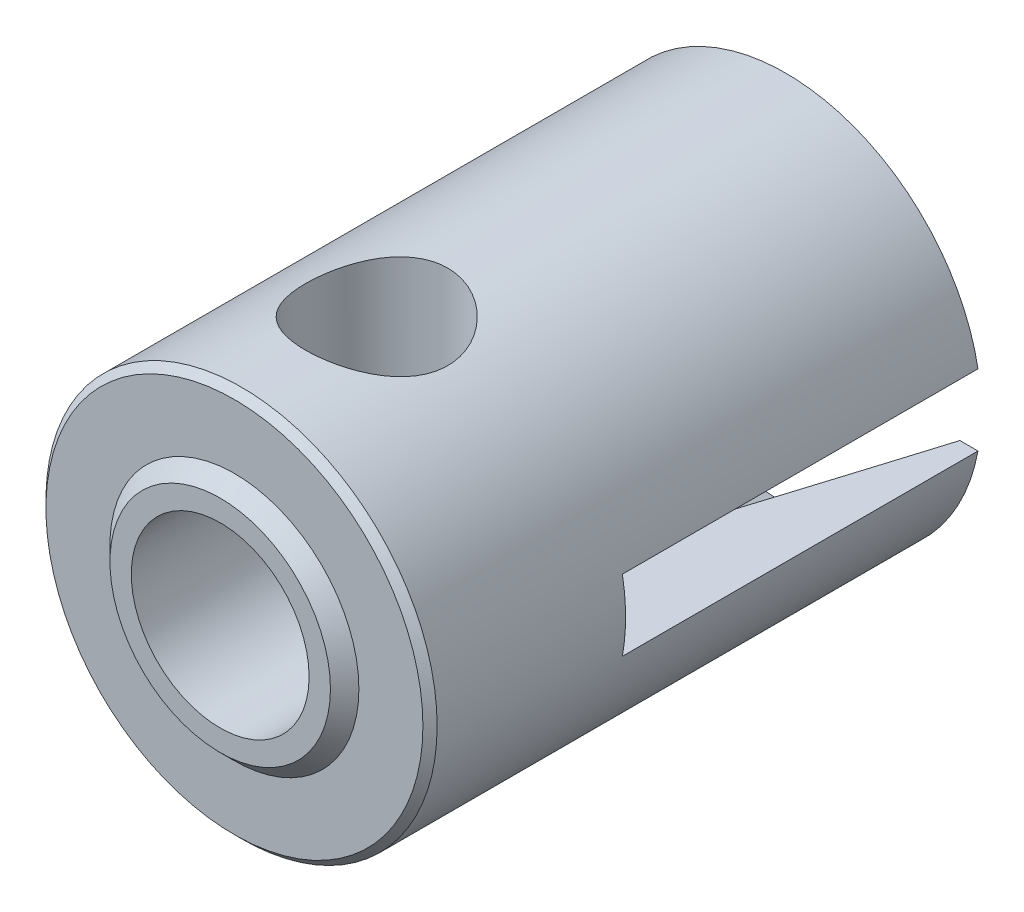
ISO-10303-21;
HEADER;
FILE_DESCRIPTION(('STEP AP214'),'2;1');
FILE_NAME('part.step','',(''),(''),'','','');
FILE_SCHEMA(('AUTOMOTIVE_DESIGN { 1 0 10303 214 1 1 1 1 }'));
ENDSEC;
DATA;
#1=APPLICATION_CONTEXT('core data for automotive mechanical design processes');
#2=APPLICATION_PROTOCOL_DEFINITION('international standard','automotive_design',2000,#1);
#3=PRODUCT_CONTEXT('',#1,'mechanical');
#4=PRODUCT('Part','Part','',(#3));
#5=PRODUCT_RELATED_PRODUCT_CATEGORY('part','',(#4));
#6=PRODUCT_DEFINITION_FORMATION('','',#4);
#7=PRODUCT_DEFINITION_CONTEXT('part definition',#1,'design');
#8=PRODUCT_DEFINITION('design','',#6,#7);
#9=PRODUCT_DEFINITION_SHAPE('','',#8);
#10=(LENGTH_UNIT() NAMED_UNIT(*) SI_UNIT(.MILLI.,.METRE.));
#11=(NAMED_UNIT(*) PLANE_ANGLE_UNIT() SI_UNIT($,.RADIAN.));
#12=(NAMED_UNIT(*) SI_UNIT($,.STERADIAN.) SOLID_ANGLE_UNIT());
#13=UNCERTAINTY_MEASURE_WITH_UNIT(LENGTH_MEASURE(1.E-05),#10,'distance_accuracy_value','');
#14=(GEOMETRIC_REPRESENTATION_CONTEXT(3) GLOBAL_UNCERTAINTY_ASSIGNED_CONTEXT((#13)) GLOBAL_UNIT_ASSIGNED_CONTEXT((#10,
#11,#12)) REPRESENTATION_CONTEXT('',''));
#15=CARTESIAN_POINT('',(0.,0.,0.));
#16=DIRECTION('',(0.,0.,1.));
#17=DIRECTION('',(1.,0.,0.));
#18=AXIS2_PLACEMENT_3D('',#15,#16,#17);
#19=CARTESIAN_POINT('',(0.,0.,0.));
#20=DIRECTION('',(0.,0.,1.));
#21=DIRECTION('',(1.,0.,0.));
#22=AXIS2_PLACEMENT_3D('',#19,#20,#21);
#23=PLANE('',#22);
#24=CARTESIAN_POINT('',(0.,0.,0.));
#25=DIRECTION('',(0.,0.,1.));
#26=DIRECTION('',(1.,0.,0.));
#27=AXIS2_PLACEMENT_3D('',#24,#25,#26);
#28=CIRCLE('',#27,5.5);
#29=CARTESIAN_POINT('',(-5.40832691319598,-1.,0.));
#30=VERTEX_POINT('',#29);
#31=CARTESIAN_POINT('',(5.40832691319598,-1.,0.));
#32=VERTEX_POINT('',#31);
#33=EDGE_CURVE('E520',#30,#32,#28,.T.);
#34=ORIENTED_EDGE('',*,*,#33,.F.);
#35=DIRECTION('',(1.,0.,0.));
#36=VECTOR('',#35,1.);
#37=CARTESIAN_POINT('',(-5.5,-1.,0.));
#38=LINE('',#37,#36);
#39=CARTESIAN_POINT('',(-4.89897948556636,-1.,0.));
#40=VERTEX_POINT('',#39);
#41=EDGE_CURVE('E626',#30,#40,#38,.T.);
#42=ORIENTED_EDGE('',*,*,#41,.T.);
#43=CARTESIAN_POINT('',(0.,0.,0.));
#44=DIRECTION('',(0.,0.,1.));
#45=DIRECTION('',(1.,0.,0.));
#46=AXIS2_PLACEMENT_3D('',#43,#44,#45);
#47=CIRCLE('',#46,5.);
#48=CARTESIAN_POINT('',(4.89897948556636,-1.,0.));
#49=VERTEX_POINT('',#48);
#50=EDGE_CURVE('E538',#40,#49,#47,.T.);
#51=ORIENTED_EDGE('',*,*,#50,.T.);
#52=EDGE_CURVE('E655',#49,#32,#38,.T.);
#53=ORIENTED_EDGE('',*,*,#52,.T.);
#54=EDGE_LOOP('',(#34,#42,#51,#53));
#55=FACE_BOUND('',#54,.T.);
#56=ADVANCED_FACE('F350',(#55),#23,.F.);
#57=CARTESIAN_POINT('',(0.,0.,9.));
#58=DIRECTION('',(0.,0.,-1.));
#59=DIRECTION('',(-1.,0.,0.));
#60=AXIS2_PLACEMENT_3D('',#57,#58,#59);
#61=PLANE('',#60);
#62=DIRECTION('',(-1.,0.,0.));
#63=VECTOR('',#62,1.);
#64=CARTESIAN_POINT('',(0.,-1.,9.));
#65=LINE('',#64,#63);
#66=CARTESIAN_POINT('',(3.35410196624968,-1.,9.));
#67=VERTEX_POINT('',#66);
#68=CARTESIAN_POINT('',(2.29128784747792,-1.,9.));
#69=VERTEX_POINT('',#68);
#70=EDGE_CURVE('E487',#67,#69,#65,.T.);
#71=ORIENTED_EDGE('',*,*,#70,.F.);
#72=CARTESIAN_POINT('',(0.,0.,9.));
#73=DIRECTION('',(0.,0.,-1.));
#74=DIRECTION('',(-1.,0.,0.));
#75=AXIS2_PLACEMENT_3D('',#72,#73,#74);
#76=CIRCLE('',#75,3.5);
#77=CARTESIAN_POINT('',(-3.35410196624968,-1.,9.));
#78=VERTEX_POINT('',#77);
#79=EDGE_CURVE('E512',#67,#78,#76,.T.);
#80=ORIENTED_EDGE('',*,*,#79,.T.);
#81=CARTESIAN_POINT('',(-2.29128784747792,-1.,9.));
#82=VERTEX_POINT('',#81);
#83=EDGE_CURVE('E490',#82,#78,#65,.T.);
#84=ORIENTED_EDGE('',*,*,#83,.F.);
#85=CARTESIAN_POINT('',(0.,0.,9.));
#86=DIRECTION('',(0.,0.,-1.));
#87=DIRECTION('',(-1.,0.,0.));
#88=AXIS2_PLACEMENT_3D('',#85,#86,#87);
#89=CIRCLE('',#88,2.5);
#90=EDGE_CURVE('E517',#82,#69,#89,.F.);
#91=ORIENTED_EDGE('',*,*,#90,.T.);
#92=EDGE_LOOP('',(#71,#80,#84,#91));
#93=FACE_BOUND('',#92,.T.);
#94=ADVANCED_FACE('F594',(#93),#61,.T.);
#95=CARTESIAN_POINT('',(0.,0.,9.));
#96=DIRECTION('',(0.,0.,-1.));
#97=DIRECTION('',(-1.,0.,0.));
#98=AXIS2_PLACEMENT_3D('',#95,#96,#97);
#99=CYLINDRICAL_SURFACE('',#98,3.5);
#100=CARTESIAN_POINT('',(0.,0.,5.));
#101=DIRECTION('',(0.,0.,1.));
#102=DIRECTION('',(1.,0.,0.));
#103=AXIS2_PLACEMENT_3D('',#100,#101,#102);
#104=CIRCLE('',#103,3.5);
#105=CARTESIAN_POINT('',(3.35410196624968,-1.,5.));
#106=VERTEX_POINT('',#105);
#107=CARTESIAN_POINT('',(-3.35410196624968,-1.,5.));
#108=VERTEX_POINT('',#107);
#109=EDGE_CURVE('E535',#106,#108,#104,.F.);
#110=ORIENTED_EDGE('',*,*,#109,.T.);
#111=DIRECTION('',(0.,0.,-1.));
#112=VECTOR('',#111,1.);
#113=CARTESIAN_POINT('',(-3.35410196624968,-1.,9.));
#114=LINE('',#113,#112);
#115=EDGE_CURVE('E493',#108,#78,#114,.F.);
#116=ORIENTED_EDGE('',*,*,#115,.T.);
#117=ORIENTED_EDGE('',*,*,#79,.F.);
#118=DIRECTION('',(0.,0.,-1.));
#119=VECTOR('',#118,1.);
#120=CARTESIAN_POINT('',(3.35410196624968,-1.,9.));
#121=LINE('',#120,#119);
#122=EDGE_CURVE('E479',#67,#106,#121,.T.);
#123=ORIENTED_EDGE('',*,*,#122,.T.);
#124=EDGE_LOOP('',(#110,#116,#117,#123));
#125=FACE_BOUND('',#124,.T.);
#126=ADVANCED_FACE('F601',(#125),#99,.F.);
#127=CARTESIAN_POINT('',(0.,0.,5.));
#128=DIRECTION('',(0.,0.,-1.));
#129=DIRECTION('',(-1.,0.,0.));
#130=AXIS2_PLACEMENT_3D('',#127,#128,#129);
#131=CONICAL_SURFACE('',#130,3.5,0.291456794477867);
#132=CARTESIAN_POINT('',(-6.51638081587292,-1.,-5.3088800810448));
#133=CARTESIAN_POINT('',(-6.34494406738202,-1.,-4.74405709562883));
#134=CARTESIAN_POINT('',(-6.17337565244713,-1.,-4.17927400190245));
#135=CARTESIAN_POINT('',(-5.82987160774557,-1.,-3.04981983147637));
#136=CARTESIAN_POINT('',(-5.65793597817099,-1.,-2.48514875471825));
#137=CARTESIAN_POINT('',(-5.31354405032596,-1.,-1.35578828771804));
#138=CARTESIAN_POINT('',(-5.14108761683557,-1.,-0.791098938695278));
#139=CARTESIAN_POINT('',(-4.79553897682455,-1.,0.338085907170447));
#140=CARTESIAN_POINT('',(-4.62244676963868,-1.,0.9025814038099));
#141=CARTESIAN_POINT('',(-4.27538625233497,-1.,2.03129424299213));
#142=CARTESIAN_POINT('',(-4.10141795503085,-1.,2.5955115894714));
#143=CARTESIAN_POINT('',(-3.83950774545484,-1.,3.44153975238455));
#144=CARTESIAN_POINT('',(-3.75204492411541,-1.,3.72349882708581));
#145=CARTESIAN_POINT('',(-3.57671998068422,-1.,4.28729403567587));
#146=CARTESIAN_POINT('',(-3.48885785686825,-1.,4.56913016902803));
#147=CARTESIAN_POINT('',(-3.22458264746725,-1.,5.41429940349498));
#148=CARTESIAN_POINT('',(-3.04744558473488,-1.,5.97740708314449));
#149=CARTESIAN_POINT('',(-2.77932712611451,-1.,6.82130026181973));
#150=CARTESIAN_POINT('',(-2.68955246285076,-1.,7.10246900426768));
#151=CARTESIAN_POINT('',(-2.50891248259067,-1.,7.66445565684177));
#152=CARTESIAN_POINT('',(-2.41804716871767,-1.,7.94527356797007));
#153=CARTESIAN_POINT('',(-2.23478363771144,-1.,8.50650029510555));
#154=CARTESIAN_POINT('',(-2.14238497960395,-1.,8.7869089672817));
#155=CARTESIAN_POINT('',(-1.95542554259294,-1.,9.34699050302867));
#156=CARTESIAN_POINT('',(-1.8608648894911,-1.,9.62666340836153));
#157=CARTESIAN_POINT('',(-1.71648742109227,-1.,10.0453420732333));
#158=CARTESIAN_POINT('',(-1.66793198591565,-1.,10.1847823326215));
#159=CARTESIAN_POINT('',(-1.56973068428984,-1.,10.4632753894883));
#160=CARTESIAN_POINT('',(-1.52008484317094,-1.,10.6023281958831));
#161=CARTESIAN_POINT('',(-1.41935257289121,-1.,10.8799422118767));
#162=CARTESIAN_POINT('',(-1.36826588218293,-1.,11.0185033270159));
#163=CARTESIAN_POINT('',(-1.29016387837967,-1.,11.2257969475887));
#164=CARTESIAN_POINT('',(-1.26388349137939,-1.,11.2948061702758));
#165=CARTESIAN_POINT('',(-1.21073086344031,-1.,11.432597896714));
#166=CARTESIAN_POINT('',(-1.18385860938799,-1.,11.5013803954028));
#167=CARTESIAN_POINT('',(-1.15664010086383,-1.,11.5700268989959));
#168=B_SPLINE_CURVE_WITH_KNOTS('',3,(#132,#133,#134,#135,#136,#137,#138,#139,#140,#141,#142,
#143,#144,#145,#146,#147,#148,#149,#150,#151,#152,#153,#154,#155,#156,#157,#158,#159,#160,#161,
#162,#163,#164,#165,#166,#167),.UNSPECIFIED.,.F.,.F.,(4,2,2,2,2,2,2,2,2,2,2,2,2,2,2,2,2,4),(0.,
1.77080218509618,3.54160344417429,5.31291271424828,7.08422383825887,8.85550912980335,
9.74114756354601,10.626789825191,12.3977172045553,13.2831750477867,14.1686303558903,
15.0543448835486,15.940008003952,16.3829616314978,16.8259049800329,17.2689292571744,
17.4904587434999,17.7119931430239),.UNSPECIFIED.);
#169=EDGE_CURVE('E576',#108,#40,#168,.F.);
#170=ORIENTED_EDGE('',*,*,#169,.F.);
#171=ORIENTED_EDGE('',*,*,#109,.F.);
#172=CARTESIAN_POINT('',(6.51638081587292,-1.,-5.3088800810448));
#173=CARTESIAN_POINT('',(6.34494406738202,-1.,-4.74405709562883));
#174=CARTESIAN_POINT('',(6.17337565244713,-1.,-4.17927400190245));
#175=CARTESIAN_POINT('',(5.82987160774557,-1.,-3.04981983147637));
#176=CARTESIAN_POINT('',(5.65793597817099,-1.,-2.48514875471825));
#177=CARTESIAN_POINT('',(5.31354405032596,-1.,-1.35578828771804));
#178=CARTESIAN_POINT('',(5.14108761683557,-1.,-0.791098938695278));
#179=CARTESIAN_POINT('',(4.79553897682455,-1.,0.338085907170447));
#180=CARTESIAN_POINT('',(4.62244676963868,-1.,0.9025814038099));
#181=CARTESIAN_POINT('',(4.27538625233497,-1.,2.03129424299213));
#182=CARTESIAN_POINT('',(4.10141795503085,-1.,2.5955115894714));
#183=CARTESIAN_POINT('',(3.83950774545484,-1.,3.44153975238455));
#184=CARTESIAN_POINT('',(3.75204492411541,-1.,3.72349882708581));
#185=CARTESIAN_POINT('',(3.57671998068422,-1.,4.28729403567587));
#186=CARTESIAN_POINT('',(3.48885785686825,-1.,4.56913016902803));
#187=CARTESIAN_POINT('',(3.22458264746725,-1.,5.41429940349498));
#188=CARTESIAN_POINT('',(3.04744558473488,-1.,5.97740708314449));
#189=CARTESIAN_POINT('',(2.77932712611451,-1.,6.82130026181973));
#190=CARTESIAN_POINT('',(2.68955246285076,-1.,7.10246900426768));
#191=CARTESIAN_POINT('',(2.50891248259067,-1.,7.66445565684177));
#192=CARTESIAN_POINT('',(2.41804716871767,-1.,7.94527356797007));
#193=CARTESIAN_POINT('',(2.23478363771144,-1.,8.50650029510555));
#194=CARTESIAN_POINT('',(2.14238497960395,-1.,8.7869089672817));
#195=CARTESIAN_POINT('',(1.95542554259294,-1.,9.34699050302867));
#196=CARTESIAN_POINT('',(1.8608648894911,-1.,9.62666340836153));
#197=CARTESIAN_POINT('',(1.71648742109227,-1.,10.0453420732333));
#198=CARTESIAN_POINT('',(1.66793198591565,-1.,10.1847823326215));
#199=CARTESIAN_POINT('',(1.56973068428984,-1.,10.4632753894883));
#200=CARTESIAN_POINT('',(1.52008484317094,-1.,10.6023281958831));
#201=CARTESIAN_POINT('',(1.41935257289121,-1.,10.8799422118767));
#202=CARTESIAN_POINT('',(1.36826588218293,-1.,11.0185033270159));
#203=CARTESIAN_POINT('',(1.29016387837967,-1.,11.2257969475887));
#204=CARTESIAN_POINT('',(1.26388349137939,-1.,11.2948061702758));
#205=CARTESIAN_POINT('',(1.21073086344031,-1.,11.432597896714));
#206=CARTESIAN_POINT('',(1.18385860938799,-1.,11.5013803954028));
#207=CARTESIAN_POINT('',(1.15664010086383,-1.,11.5700268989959));
#208=B_SPLINE_CURVE_WITH_KNOTS('',3,(#172,#173,#174,#175,#176,#177,#178,#179,#180,#181,#182,
#183,#184,#185,#186,#187,#188,#189,#190,#191,#192,#193,#194,#195,#196,#197,#198,#199,#200,#201,
#202,#203,#204,#205,#206,#207),.UNSPECIFIED.,.F.,.F.,(4,2,2,2,2,2,2,2,2,2,2,2,2,2,2,2,2,4),(0.,
1.77080218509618,3.54160344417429,5.31291271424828,7.08422383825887,8.85550912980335,
9.74114756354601,10.626789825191,12.3977172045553,13.2831750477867,14.1686303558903,
15.0543448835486,15.940008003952,16.3829616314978,16.8259049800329,17.2689292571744,
17.4904587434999,17.7119931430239),.UNSPECIFIED.);
#209=EDGE_CURVE('E571',#49,#106,#208,.T.);
#210=ORIENTED_EDGE('',*,*,#209,.F.);
#211=ORIENTED_EDGE('',*,*,#50,.F.);
#212=EDGE_LOOP('',(#170,#171,#210,#211));
#213=FACE_BOUND('',#212,.T.);
#214=ADVANCED_FACE('F564',(#213),#131,.F.);
#215=CARTESIAN_POINT('',(0.,0.,0.));
#216=DIRECTION('',(0.,0.,1.));
#217=DIRECTION('',(1.,0.,0.));
#218=AXIS2_PLACEMENT_3D('',#215,#216,#217);
#219=CYLINDRICAL_SURFACE('',#218,2.5);
#220=CARTESIAN_POINT('',(0.,2.5,9.5));
#221=CARTESIAN_POINT('',(-0.0959968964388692,2.49999264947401,9.50000757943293));
#222=CARTESIAN_POINT('',(-0.192133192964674,2.49441368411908,9.50696942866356));
#223=CARTESIAN_POINT('',(-0.381319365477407,2.47259269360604,9.53434994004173));
#224=CARTESIAN_POINT('',(-0.474361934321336,2.45632708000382,9.55479837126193));
#225=CARTESIAN_POINT('',(-0.654094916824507,2.4146672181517,9.60767827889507));
#226=CARTESIAN_POINT('',(-0.740821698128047,2.38933120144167,9.64003335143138));
#227=CARTESIAN_POINT('',(-0.906926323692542,2.33136010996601,9.71511734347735));
#228=CARTESIAN_POINT('',(-0.986304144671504,2.29872501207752,9.75784629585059));
#229=CARTESIAN_POINT('',(-1.16318123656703,2.21575664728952,9.86862836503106));
#230=CARTESIAN_POINT('',(-1.25736767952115,2.16321748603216,9.94031891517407));
#231=CARTESIAN_POINT('',(-1.43041367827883,2.05292192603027,10.0972780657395));
#232=CARTESIAN_POINT('',(-1.50922761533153,1.99515072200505,10.1825857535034));
#233=CARTESIAN_POINT('',(-1.6521591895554,1.87856001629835,10.3667739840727));
#234=CARTESIAN_POINT('',(-1.71602638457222,1.81973830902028,10.4658467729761));
#235=CARTESIAN_POINT('',(-1.82646834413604,1.7088210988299,10.6765387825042));
#236=CARTESIAN_POINT('',(-1.87310099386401,1.65670347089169,10.788114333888));
#237=CARTESIAN_POINT('',(-1.93086043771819,1.58835652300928,10.973878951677));
#238=CARTESIAN_POINT('',(-1.94865475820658,1.56628727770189,11.0438117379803));
#239=CARTESIAN_POINT('',(-1.97673396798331,1.53069889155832,11.1872126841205));
#240=CARTESIAN_POINT('',(-1.98703731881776,1.5171587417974,11.260671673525));
#241=CARTESIAN_POINT('',(-1.99939840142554,1.50084234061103,11.410192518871));
#242=CARTESIAN_POINT('',(-2.00138345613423,1.49816096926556,11.4862714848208));
#243=CARTESIAN_POINT('',(-1.99669481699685,1.50439962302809,11.6377048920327));
#244=CARTESIAN_POINT('',(-1.99001379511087,1.51332946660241,11.7130586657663));
#245=CARTESIAN_POINT('',(-1.9669530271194,1.5432072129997,11.8722223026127));
#246=CARTESIAN_POINT('',(-1.94921808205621,1.56581842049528,11.955508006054));
#247=CARTESIAN_POINT('',(-1.90444547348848,1.61997459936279,12.116535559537));
#248=CARTESIAN_POINT('',(-1.87738025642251,1.65154598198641,12.1942601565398));
#249=CARTESIAN_POINT('',(-1.79974102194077,1.73656116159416,12.380662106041));
#250=CARTESIAN_POINT('',(-1.74414886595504,1.79313372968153,12.4858026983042));
#251=CARTESIAN_POINT('',(-1.61638467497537,1.90913780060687,12.6837166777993));
#252=CARTESIAN_POINT('',(-1.54418846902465,1.96857337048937,12.7764717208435));
#253=CARTESIAN_POINT('',(-1.38145818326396,2.08612751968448,12.9512747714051));
#254=CARTESIAN_POINT('',(-1.29048701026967,2.14416889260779,13.0329719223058));
#255=CARTESIAN_POINT('',(-1.09198491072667,2.25171871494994,13.1800994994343));
#256=CARTESIAN_POINT('',(-0.98449964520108,2.3012499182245,13.2455735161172));
#257=CARTESIAN_POINT('',(-0.787777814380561,2.37424585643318,13.3405628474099));
#258=CARTESIAN_POINT('',(-0.702177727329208,2.40111071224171,13.3750045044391));
#259=CARTESIAN_POINT('',(-0.524913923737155,2.44597564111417,13.432126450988));
#260=CARTESIAN_POINT('',(-0.433254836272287,2.46398239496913,13.4548156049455));
#261=CARTESIAN_POINT('',(-0.24571323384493,2.48970335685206,13.4871385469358));
#262=CARTESIAN_POINT('',(-0.149811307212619,2.49736378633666,13.496704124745));
#263=CARTESIAN_POINT('',(0.0426080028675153,2.50148682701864,13.5018590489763));
#264=CARTESIAN_POINT('',(0.13912526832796,2.49795152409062,13.4974509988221));
#265=CARTESIAN_POINT('',(0.32174667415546,2.48076858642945,13.4759171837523));
#266=CARTESIAN_POINT('',(0.408060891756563,2.46796352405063,13.459850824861));
#267=CARTESIAN_POINT('',(0.576335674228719,2.43417513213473,13.4171278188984));
#268=CARTESIAN_POINT('',(0.658294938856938,2.41318937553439,13.3904680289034));
#269=CARTESIAN_POINT('',(0.821235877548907,2.36289849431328,13.3258496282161));
#270=CARTESIAN_POINT('',(0.901843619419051,2.33315912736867,13.2872942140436));
#271=CARTESIAN_POINT('',(1.0554100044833,2.2678362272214,13.2011378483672));
#272=CARTESIAN_POINT('',(1.12836826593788,2.23225240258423,13.1535364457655));
#273=CARTESIAN_POINT('',(1.27925237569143,2.14993687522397,13.0407756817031));
#274=CARTESIAN_POINT('',(1.35550718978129,2.1023696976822,12.973998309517));
#275=CARTESIAN_POINT('',(1.4965368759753,2.0044349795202,12.830613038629));
#276=CARTESIAN_POINT('',(1.56127777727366,1.95405970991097,12.7539771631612));
#277=CARTESIAN_POINT('',(1.65568487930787,1.87374135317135,12.6235655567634));
#278=CARTESIAN_POINT('',(1.68913741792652,1.84354743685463,12.5726394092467));
#279=CARTESIAN_POINT('',(1.75155001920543,1.78435415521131,12.4673777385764));
#280=CARTESIAN_POINT('',(1.78050769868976,1.75535542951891,12.4130404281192));
#281=CARTESIAN_POINT('',(1.83358089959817,1.69983828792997,12.3011251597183));
#282=CARTESIAN_POINT('',(1.85771431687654,1.67331090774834,12.2435602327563));
#283=CARTESIAN_POINT('',(1.90088481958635,1.62410209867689,12.124991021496));
#284=CARTESIAN_POINT('',(1.9199255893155,1.60141789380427,12.0639892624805));
#285=CARTESIAN_POINT('',(1.95360165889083,1.5601942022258,11.9339132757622));
#286=CARTESIAN_POINT('',(1.96779559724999,1.54209716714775,11.8645773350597));
#287=CARTESIAN_POINT('',(1.98878905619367,1.5149337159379,11.723162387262));
#288=CARTESIAN_POINT('',(1.99560723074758,1.50584452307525,11.6510907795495));
#289=CARTESIAN_POINT('',(2.00132058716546,1.49824736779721,11.5056512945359));
#290=CARTESIAN_POINT('',(2.00017319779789,1.49979625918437,11.4322785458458));
#291=CARTESIAN_POINT('',(1.98996519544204,1.51330771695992,11.2870158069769));
#292=CARTESIAN_POINT('',(1.98089203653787,1.52528679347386,11.2151283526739));
#293=CARTESIAN_POINT('',(1.95207745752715,1.56207076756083,11.0553932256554));
#294=CARTESIAN_POINT('',(1.93009230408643,1.5894925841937,10.9685769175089));
#295=CARTESIAN_POINT('',(1.87608177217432,1.65288907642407,10.8013665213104));
#296=CARTESIAN_POINT('',(1.84402681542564,1.68888887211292,10.7209922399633));
#297=CARTESIAN_POINT('',(1.78094746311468,1.75491158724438,10.5878222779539));
#298=CARTESIAN_POINT('',(1.7520236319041,1.78388907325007,10.5334808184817));
#299=CARTESIAN_POINT('',(1.68964733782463,1.84307948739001,10.4281617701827));
#300=CARTESIAN_POINT('',(1.65619322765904,1.87329286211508,10.3771854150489));
#301=CARTESIAN_POINT('',(1.54918435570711,1.96437997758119,10.2292205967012));
#302=CARTESIAN_POINT('',(1.4689854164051,2.02569808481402,10.1372013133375));
#303=CARTESIAN_POINT('',(1.29001718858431,2.14418278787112,9.96661053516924));
#304=CARTESIAN_POINT('',(1.19101966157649,2.201284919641,9.88822977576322));
#305=CARTESIAN_POINT('',(1.02998399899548,2.27874650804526,9.78442327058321));
#306=CARTESIAN_POINT('',(0.974255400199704,2.30318868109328,9.75213155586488));
#307=CARTESIAN_POINT('',(0.858854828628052,2.34866115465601,9.69263189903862));
#308=CARTESIAN_POINT('',(0.79918529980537,2.36969354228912,9.6654208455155));
#309=CARTESIAN_POINT('',(0.655037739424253,2.41420905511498,9.60821994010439));
#310=CARTESIAN_POINT('',(0.569110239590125,2.43602892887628,9.58051732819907));
#311=CARTESIAN_POINT('',(0.392713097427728,2.47058864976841,9.5368423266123));
#312=CARTESIAN_POINT('',(0.302256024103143,2.48335227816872,9.52083921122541));
#313=CARTESIAN_POINT('',(0.175880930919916,2.49405378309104,9.5074369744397));
#314=CARTESIAN_POINT('',(0.140808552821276,2.49627918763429,9.50465262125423));
#315=CARTESIAN_POINT('',(0.07049707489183,2.499253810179,9.50093253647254));
#316=CARTESIAN_POINT('',(0.0352579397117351,2.50000269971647,9.49999721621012));
#317=CARTESIAN_POINT('',(0.,2.5,9.5));
#318=B_SPLINE_CURVE_WITH_KNOTS('',3,(#220,#221,#222,#223,#224,#225,#226,#227,#228,#229,#230,
#231,#232,#233,#234,#235,#236,#237,#238,#239,#240,#241,#242,#243,#244,#245,#246,#247,#248,#249,
#250,#251,#252,#253,#254,#255,#256,#257,#258,#259,#260,#261,#262,#263,#264,#265,#266,#267,#268,
#269,#270,#271,#272,#273,#274,#275,#276,#277,#278,#279,#280,#281,#282,#283,#284,#285,#286,#287,
#288,#289,#290,#291,#292,#293,#294,#295,#296,#297,#298,#299,#300,#301,#302,#303,#304,#305,#306,
#307,#308,#309,#310,#311,#312,#313,#314,#315,#316,#317),.UNSPECIFIED.,.T.,.F.,(4,2,2,2,2,2,2,2,
2,2,2,2,2,2,2,2,2,2,2,2,2,2,2,2,2,2,2,2,2,2,2,2,2,2,2,2,2,2,2,2,2,2,2,2,2,2,2,2,4),(0.,
0.287836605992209,0.576310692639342,0.862965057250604,1.14962032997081,1.53607888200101,
1.92366738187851,2.31734741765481,2.70969292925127,2.9353448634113,3.1604387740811,
3.38749528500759,3.61474392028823,3.87758630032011,4.14121163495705,4.534257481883,
4.92787915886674,5.33198173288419,5.73498644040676,6.02213978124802,6.30907621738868,
6.59749843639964,6.88586692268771,7.15087004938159,7.41595185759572,7.69742753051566,
7.97891724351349,8.31365537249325,8.64936529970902,8.85316560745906,9.0570736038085,
9.26021055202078,9.46320013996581,9.68152133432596,9.89928907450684,10.1182215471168,
10.3375012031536,10.616933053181,10.8971934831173,11.1010640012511,11.3050088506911,
11.7129165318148,12.1261363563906,12.3324811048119,12.5386990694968,12.8161540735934,
13.0928777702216,13.1985714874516,13.3042887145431),.UNSPECIFIED.);
#319=CARTESIAN_POINT('',(0.,2.5,9.5));
#320=VERTEX_POINT('',#319);
#321=EDGE_CURVE('E621',#320,#320,#318,.T.);
#322=ORIENTED_EDGE('',*,*,#321,.T.);
#323=EDGE_LOOP('',(#322));
#324=FACE_BOUND('',#323,.T.);
#325=CARTESIAN_POINT('',(0.,0.,15.9));
#326=DIRECTION('',(0.,0.,1.));
#327=DIRECTION('',(1.,0.,0.));
#328=AXIS2_PLACEMENT_3D('',#325,#326,#327);
#329=CIRCLE('',#328,2.5);
#330=CARTESIAN_POINT('',(2.5,0.,15.9));
#331=VERTEX_POINT('',#330);
#332=EDGE_CURVE('E513',#331,#331,#329,.T.);
#333=ORIENTED_EDGE('',*,*,#332,.T.);
#334=EDGE_LOOP('',(#333));
#335=FACE_BOUND('',#334,.T.);
#336=ORIENTED_EDGE('',*,*,#90,.F.);
#337=DIRECTION('',(0.,0.,1.));
#338=VECTOR('',#337,1.);
#339=CARTESIAN_POINT('',(-2.29128784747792,-1.,0.));
#340=LINE('',#339,#338);
#341=CARTESIAN_POINT('',(-2.29128784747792,-1.,10.));
#342=VERTEX_POINT('',#341);
#343=EDGE_CURVE('E496',#82,#342,#340,.T.);
#344=ORIENTED_EDGE('',*,*,#343,.T.);
#345=CARTESIAN_POINT('',(0.,0.,10.));
#346=DIRECTION('',(0.,0.,1.));
#347=DIRECTION('',(1.,0.,0.));
#348=AXIS2_PLACEMENT_3D('',#345,#346,#347);
#349=CIRCLE('',#348,2.5);
#350=CARTESIAN_POINT('',(-2.29128784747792,0.999999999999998,10.));
#351=VERTEX_POINT('',#350);
#352=EDGE_CURVE('E507',#342,#351,#349,.F.);
#353=ORIENTED_EDGE('',*,*,#352,.T.);
#354=DIRECTION('',(0.,0.,1.));
#355=VECTOR('',#354,1.);
#356=CARTESIAN_POINT('',(-2.29128784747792,1.,0.));
#357=LINE('',#356,#355);
#358=CARTESIAN_POINT('',(-2.29128784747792,0.999999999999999,9.));
#359=VERTEX_POINT('',#358);
#360=EDGE_CURVE('E469',#351,#359,#357,.F.);
#361=ORIENTED_EDGE('',*,*,#360,.T.);
#362=CARTESIAN_POINT('',(2.29128784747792,0.999999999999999,9.));
#363=VERTEX_POINT('',#362);
#364=EDGE_CURVE('E511',#363,#359,#89,.F.);
#365=ORIENTED_EDGE('',*,*,#364,.F.);
#366=DIRECTION('',(0.,0.,1.));
#367=VECTOR('',#366,1.);
#368=CARTESIAN_POINT('',(2.29128784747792,1.,0.));
#369=LINE('',#368,#367);
#370=CARTESIAN_POINT('',(2.29128784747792,0.999999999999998,10.));
#371=VERTEX_POINT('',#370);
#372=EDGE_CURVE('E628',#363,#371,#369,.T.);
#373=ORIENTED_EDGE('',*,*,#372,.T.);
#374=CARTESIAN_POINT('',(2.29128784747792,-1.,10.));
#375=VERTEX_POINT('',#374);
#376=EDGE_CURVE('E504',#371,#375,#349,.F.);
#377=ORIENTED_EDGE('',*,*,#376,.T.);
#378=DIRECTION('',(0.,0.,1.));
#379=VECTOR('',#378,1.);
#380=CARTESIAN_POINT('',(2.29128784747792,-1.,0.));
#381=LINE('',#380,#379);
#382=EDGE_CURVE('E489',#375,#69,#381,.F.);
#383=ORIENTED_EDGE('',*,*,#382,.T.);
#384=EDGE_LOOP('',(#336,#344,#353,#361,#365,#373,#377,#383));
#385=FACE_BOUND('',#384,.T.);
#386=ADVANCED_FACE('F642',(#324,#335,#385),#219,.F.);
#387=CARTESIAN_POINT('',(0.,0.,15.5));
#388=DIRECTION('',(0.,0.,1.));
#389=DIRECTION('',(1.,0.,0.));
#390=AXIS2_PLACEMENT_3D('',#387,#388,#389);
#391=PLANE('',#390);
#392=CARTESIAN_POINT('',(0.,0.,15.5));
#393=DIRECTION('',(0.,0.,1.));
#394=DIRECTION('',(1.,0.,0.));
#395=AXIS2_PLACEMENT_3D('',#392,#393,#394);
#396=CIRCLE('',#395,5.3);
#397=CARTESIAN_POINT('',(5.3,0.,15.5));
#398=VERTEX_POINT('',#397);
#399=EDGE_CURVE('E526',#398,#398,#396,.T.);
#400=ORIENTED_EDGE('',*,*,#399,.T.);
#401=EDGE_LOOP('',(#400));
#402=FACE_BOUND('',#401,.T.);
#403=CARTESIAN_POINT('',(0.,0.,15.5));
#404=DIRECTION('',(0.,0.,1.));
#405=DIRECTION('',(1.,0.,0.));
#406=AXIS2_PLACEMENT_3D('',#403,#404,#405);
#407=CIRCLE('',#406,3.5);
#408=CARTESIAN_POINT('',(3.5,0.,15.5));
#409=VERTEX_POINT('',#408);
#410=EDGE_CURVE('E516',#409,#409,#407,.T.);
#411=ORIENTED_EDGE('',*,*,#410,.F.);
#412=EDGE_LOOP('',(#411));
#413=FACE_BOUND('',#412,.T.);
#414=ADVANCED_FACE('F614',(#402,#413),#391,.T.);
#415=CARTESIAN_POINT('',(0.,0.,15.5));
#416=DIRECTION('',(0.,0.,-1.));
#417=DIRECTION('',(-1.,0.,0.));
#418=AXIS2_PLACEMENT_3D('',#415,#416,#417);
#419=CYLINDRICAL_SURFACE('',#418,5.5);
#420=CARTESIAN_POINT('',(0.,5.5,9.5));
#421=CARTESIAN_POINT('',(0.1085431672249,5.50000205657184,9.49999718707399));
#422=CARTESIAN_POINT('',(0.217066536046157,5.49675838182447,9.50886419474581));
#423=CARTESIAN_POINT('',(0.430882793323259,5.4841414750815,9.54396445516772));
#424=CARTESIAN_POINT('',(0.536175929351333,5.47476871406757,9.5701963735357));
#425=CARTESIAN_POINT('',(0.740417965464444,5.45090325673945,9.63898471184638));
#426=CARTESIAN_POINT('',(0.839378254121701,5.43642007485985,9.68151080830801));
#427=CARTESIAN_POINT('',(1.02875621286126,5.4037862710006,9.78153094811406));
#428=CARTESIAN_POINT('',(1.11917173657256,5.38563473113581,9.83902873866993));
#429=CARTESIAN_POINT('',(1.29253694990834,5.34673088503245,9.96978398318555));
#430=CARTESIAN_POINT('',(1.37509612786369,5.32590805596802,10.0435380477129));
#431=CARTESIAN_POINT('',(1.52698399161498,5.28436672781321,10.2036577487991));
#432=CARTESIAN_POINT('',(1.59630897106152,5.26364825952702,10.2900269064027));
#433=CARTESIAN_POINT('',(1.72217040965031,5.2238538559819,10.47665504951));
#434=CARTESIAN_POINT('',(1.77816779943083,5.20486193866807,10.5772972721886));
#435=CARTESIAN_POINT('',(1.87226939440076,5.17176122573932,10.7873714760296));
#436=CARTESIAN_POINT('',(1.91038026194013,5.15765061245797,10.8968001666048));
#437=CARTESIAN_POINT('',(1.9661067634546,5.13666087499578,11.1168586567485));
#438=CARTESIAN_POINT('',(1.98446417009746,5.12952103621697,11.2272749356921));
#439=CARTESIAN_POINT('',(2.00248218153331,5.12251577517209,11.4498337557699));
#440=CARTESIAN_POINT('',(2.0021499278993,5.12264757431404,11.5619756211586));
#441=CARTESIAN_POINT('',(1.98336767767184,5.1299448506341,11.7781522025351));
#442=CARTESIAN_POINT('',(1.96592854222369,5.13671788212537,11.8822904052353));
#443=CARTESIAN_POINT('',(1.91509242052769,5.15588510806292,12.0860464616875));
#444=CARTESIAN_POINT('',(1.88169317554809,5.16828009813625,12.185663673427));
#445=CARTESIAN_POINT('',(1.79930048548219,5.19754287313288,12.3796763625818));
#446=CARTESIAN_POINT('',(1.75003450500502,5.21448789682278,12.4739439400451));
#447=CARTESIAN_POINT('',(1.63749646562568,5.25091385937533,12.6531747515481));
#448=CARTESIAN_POINT('',(1.57421978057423,5.27039563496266,12.738134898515));
#449=CARTESIAN_POINT('',(1.43076675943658,5.31119569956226,12.9019597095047));
#450=CARTESIAN_POINT('',(1.34977782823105,5.33255243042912,12.9801049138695));
#451=CARTESIAN_POINT('',(1.17559287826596,5.37363749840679,13.1219110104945));
#452=CARTESIAN_POINT('',(1.08239520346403,5.39336561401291,13.1855699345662));
#453=CARTESIAN_POINT('',(0.884691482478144,5.42932219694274,13.2973271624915));
#454=CARTESIAN_POINT('',(0.780047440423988,5.44549875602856,13.345199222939));
#455=CARTESIAN_POINT('',(0.563457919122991,5.47214720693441,13.4224251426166));
#456=CARTESIAN_POINT('',(0.45151550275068,5.48262147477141,13.451786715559));
#457=CARTESIAN_POINT('',(0.229572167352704,5.49627428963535,13.4898060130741));
#458=CARTESIAN_POINT('',(0.119758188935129,5.49979422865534,13.4994334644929));
#459=CARTESIAN_POINT('',(-0.0999591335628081,5.50018795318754,13.5005175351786));
#460=CARTESIAN_POINT('',(-0.209862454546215,5.49706310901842,13.4919779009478));
#461=CARTESIAN_POINT('',(-0.422536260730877,5.48474392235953,13.4577165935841));
#462=CARTESIAN_POINT('',(-0.525421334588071,5.47577009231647,13.432618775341));
#463=CARTESIAN_POINT('',(-0.725457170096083,5.45287588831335,13.3667631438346));
#464=CARTESIAN_POINT('',(-0.822607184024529,5.43895487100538,13.326003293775));
#465=CARTESIAN_POINT('',(-1.01153077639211,5.40705571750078,13.2287044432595));
#466=CARTESIAN_POINT('',(-1.10307043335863,5.38897272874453,13.1717466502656));
#467=CARTESIAN_POINT('',(-1.27559067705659,5.35076522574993,13.0441469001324));
#468=CARTESIAN_POINT('',(-1.35656752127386,5.3306399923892,12.9735001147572));
#469=CARTESIAN_POINT('',(-1.51027155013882,5.28921180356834,12.8159922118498));
#470=CARTESIAN_POINT('',(-1.58230898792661,5.26790441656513,12.7284574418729));
#471=CARTESIAN_POINT('',(-1.71079410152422,5.22759328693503,12.5421090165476));
#472=CARTESIAN_POINT('',(-1.76724080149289,5.20858968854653,12.4432946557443));
#473=CARTESIAN_POINT('',(-1.86289185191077,5.17515419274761,12.2366270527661));
#474=CARTESIAN_POINT('',(-1.90205961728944,5.16073201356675,12.1287552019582));
#475=CARTESIAN_POINT('',(-1.96143954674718,5.13846087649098,11.9072825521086));
#476=CARTESIAN_POINT('',(-1.98166249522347,5.13060817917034,11.7936850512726));
#477=CARTESIAN_POINT('',(-2.00164701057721,5.12284228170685,11.5714086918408));
#478=CARTESIAN_POINT('',(-2.00257568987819,5.1224762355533,11.4628496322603));
#479=CARTESIAN_POINT('',(-1.98690232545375,5.12857566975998,11.2472104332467));
#480=CARTESIAN_POINT('',(-1.97030174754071,5.13504057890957,11.1401301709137));
#481=CARTESIAN_POINT('',(-1.92092825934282,5.15370717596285,10.9334050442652));
#482=CARTESIAN_POINT('',(-1.88860353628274,5.16574946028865,10.8336375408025));
#483=CARTESIAN_POINT('',(-1.80908422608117,5.19413013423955,10.6408772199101));
#484=CARTESIAN_POINT('',(-1.76188599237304,5.21046957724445,10.5478860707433));
#485=CARTESIAN_POINT('',(-1.6512114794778,5.24662240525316,10.3662585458));
#486=CARTESIAN_POINT('',(-1.58703826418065,5.26656880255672,10.2780736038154));
#487=CARTESIAN_POINT('',(-1.44534172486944,5.30720401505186,10.1133498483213));
#488=CARTESIAN_POINT('',(-1.36781428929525,5.32789305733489,10.036814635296));
#489=CARTESIAN_POINT('',(-1.19700369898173,5.36891606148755,9.89370053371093));
#490=CARTESIAN_POINT('',(-1.10312945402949,5.38918141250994,9.82780450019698));
#491=CARTESIAN_POINT('',(-0.904935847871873,5.42597802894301,9.71276292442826));
#492=CARTESIAN_POINT('',(-0.800616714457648,5.44250937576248,9.66361701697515));
#493=CARTESIAN_POINT('',(-0.58242281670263,5.47019903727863,9.5830903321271));
#494=CARTESIAN_POINT('',(-0.468408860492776,5.48125425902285,9.55204859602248));
#495=CARTESIAN_POINT('',(-0.23625426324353,5.49615207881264,9.51050935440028));
#496=CARTESIAN_POINT('',(-0.118115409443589,5.49999776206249,9.5000030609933));
#497=CARTESIAN_POINT('',(0.,5.5,9.5));
#498=B_SPLINE_CURVE_WITH_KNOTS('',3,(#420,#421,#422,#423,#424,#425,#426,#427,#428,#429,#430,
#431,#432,#433,#434,#435,#436,#437,#438,#439,#440,#441,#442,#443,#444,#445,#446,#447,#448,#449,
#450,#451,#452,#453,#454,#455,#456,#457,#458,#459,#460,#461,#462,#463,#464,#465,#466,#467,#468,
#469,#470,#471,#472,#473,#474,#475,#476,#477,#478,#479,#480,#481,#482,#483,#484,#485,#486,#487,
#488,#489,#490,#491,#492,#493,#494,#495,#496,#497),.UNSPECIFIED.,.T.,.F.,(4,2,2,2,2,2,2,2,2,2,2,
2,2,2,2,2,2,2,2,2,2,2,2,2,2,2,2,2,2,2,2,2,2,2,2,2,2,2,4),(0.,0.325194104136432,0.65036322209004,
0.974930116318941,1.29957832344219,1.63601964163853,1.97255504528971,2.32099392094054,
2.66930290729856,3.00401939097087,3.33860797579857,3.65454759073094,3.97053193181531,
4.29226244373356,4.61409934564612,4.95617818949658,5.29830348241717,5.64513792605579,
5.99182774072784,6.32102805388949,6.65016048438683,6.96755079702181,7.2849823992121,
7.61151258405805,7.93815814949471,8.28259860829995,8.62706062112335,8.97224851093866,
9.31723978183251,9.64129740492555,9.96532793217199,10.2806204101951,10.5959902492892,
10.9271566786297,11.2584252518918,11.6061385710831,11.9538443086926,12.3078682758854,
12.6617407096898),.UNSPECIFIED.);
#499=CARTESIAN_POINT('',(0.,5.5,9.5));
#500=VERTEX_POINT('',#499);
#501=EDGE_CURVE('E11',#500,#500,#498,.T.);
#502=ORIENTED_EDGE('',*,*,#501,.T.);
#503=EDGE_LOOP('',(#502));
#504=FACE_BOUND('',#503,.T.);
#505=CARTESIAN_POINT('',(0.,0.,15.3));
#506=DIRECTION('',(0.,0.,1.));
#507=DIRECTION('',(1.,0.,0.));
#508=AXIS2_PLACEMENT_3D('',#505,#506,#507);
#509=CIRCLE('',#508,5.5);
#510=CARTESIAN_POINT('',(5.5,0.,15.3));
#511=VERTEX_POINT('',#510);
#512=EDGE_CURVE('E529',#511,#511,#509,.F.);
#513=ORIENTED_EDGE('',*,*,#512,.T.);
#514=EDGE_LOOP('',(#513));
#515=FACE_BOUND('',#514,.T.);
#516=CARTESIAN_POINT('',(0.,0.,10.));
#517=DIRECTION('',(0.,0.,1.));
#518=DIRECTION('',(1.,0.,0.));
#519=AXIS2_PLACEMENT_3D('',#516,#517,#518);
#520=CIRCLE('',#519,5.5);
#521=CARTESIAN_POINT('',(5.40832691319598,-1.,10.));
#522=VERTEX_POINT('',#521);
#523=CARTESIAN_POINT('',(5.40832691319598,0.999999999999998,10.));
#524=VERTEX_POINT('',#523);
#525=EDGE_CURVE('E465',#522,#524,#520,.T.);
#526=ORIENTED_EDGE('',*,*,#525,.T.);
#527=DIRECTION('',(0.,0.,-1.));
#528=VECTOR('',#527,1.);
#529=CARTESIAN_POINT('',(5.40832691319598,0.999999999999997,15.5));
#530=LINE('',#529,#528);
#531=CARTESIAN_POINT('',(5.40832691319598,1.,0.));
#532=VERTEX_POINT('',#531);
#533=EDGE_CURVE('E477',#524,#532,#530,.T.);
#534=ORIENTED_EDGE('',*,*,#533,.T.);
#535=CARTESIAN_POINT('',(-5.40832691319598,1.,0.));
#536=VERTEX_POINT('',#535);
#537=EDGE_CURVE('E476',#532,#536,#28,.T.);
#538=ORIENTED_EDGE('',*,*,#537,.T.);
#539=DIRECTION('',(0.,0.,-1.));
#540=VECTOR('',#539,1.);
#541=CARTESIAN_POINT('',(-5.40832691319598,0.999999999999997,15.5));
#542=LINE('',#541,#540);
#543=CARTESIAN_POINT('',(-5.40832691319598,0.999999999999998,10.));
#544=VERTEX_POINT('',#543);
#545=EDGE_CURVE('E467',#536,#544,#542,.F.);
#546=ORIENTED_EDGE('',*,*,#545,.T.);
#547=CARTESIAN_POINT('',(-5.40832691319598,-1.,10.));
#548=VERTEX_POINT('',#547);
#549=EDGE_CURVE('E362',#544,#548,#520,.T.);
#550=ORIENTED_EDGE('',*,*,#549,.T.);
#551=DIRECTION('',(0.,0.,-1.));
#552=VECTOR('',#551,1.);
#553=CARTESIAN_POINT('',(-5.40832691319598,-1.,15.5));
#554=LINE('',#553,#552);
#555=EDGE_CURVE('E502',#548,#30,#554,.T.);
#556=ORIENTED_EDGE('',*,*,#555,.T.);
#557=ORIENTED_EDGE('',*,*,#33,.T.);
#558=DIRECTION('',(0.,0.,-1.));
#559=VECTOR('',#558,1.);
#560=CARTESIAN_POINT('',(5.40832691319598,-1.,15.5));
#561=LINE('',#560,#559);
#562=EDGE_CURVE('E499',#32,#522,#561,.F.);
#563=ORIENTED_EDGE('',*,*,#562,.T.);
#564=EDGE_LOOP('',(#526,#534,#538,#546,#550,#556,#557,#563));
#565=FACE_BOUND('',#564,.T.);
#566=ADVANCED_FACE('F352',(#504,#515,#565),#419,.T.);
#567=ORIENTED_EDGE('',*,*,#537,.F.);
#568=DIRECTION('',(1.,0.,0.));
#569=VECTOR('',#568,1.);
#570=CARTESIAN_POINT('',(-5.5,1.,0.));
#571=LINE('',#570,#569);
#572=CARTESIAN_POINT('',(4.89897948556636,1.,0.));
#573=VERTEX_POINT('',#572);
#574=EDGE_CURVE('E617',#573,#532,#571,.T.);
#575=ORIENTED_EDGE('',*,*,#574,.F.);
#576=CARTESIAN_POINT('',(-4.89897948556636,1.,0.));
#577=VERTEX_POINT('',#576);
#578=EDGE_CURVE('E539',#573,#577,#47,.T.);
#579=ORIENTED_EDGE('',*,*,#578,.T.);
#580=EDGE_CURVE('E377',#536,#577,#571,.T.);
#581=ORIENTED_EDGE('',*,*,#580,.F.);
#582=EDGE_LOOP('',(#567,#575,#579,#581));
#583=FACE_BOUND('',#582,.T.);
#584=ADVANCED_FACE('F597',(#583),#23,.F.);
#585=CARTESIAN_POINT('',(0.,0.,15.9));
#586=DIRECTION('',(0.,0.,1.));
#587=DIRECTION('',(1.,0.,0.));
#588=AXIS2_PLACEMENT_3D('',#585,#586,#587);
#589=PLANE('',#588);
#590=ORIENTED_EDGE('',*,*,#332,.F.);
#591=EDGE_LOOP('',(#590));
#592=FACE_BOUND('',#591,.T.);
#593=CARTESIAN_POINT('',(0.,0.,15.9));
#594=DIRECTION('',(0.,0.,1.));
#595=DIRECTION('',(1.,0.,0.));
#596=AXIS2_PLACEMENT_3D('',#593,#594,#595);
#597=CIRCLE('',#596,3.1);
#598=CARTESIAN_POINT('',(3.1,0.,15.9));
#599=VERTEX_POINT('',#598);
#600=EDGE_CURVE('E523',#599,#599,#597,.T.);
#601=ORIENTED_EDGE('',*,*,#600,.T.);
#602=EDGE_LOOP('',(#601));
#603=FACE_BOUND('',#602,.T.);
#604=ADVANCED_FACE('F606',(#592,#603),#589,.T.);
#605=CARTESIAN_POINT('',(0.,0.,15.9));
#606=DIRECTION('',(0.,0.,-1.));
#607=DIRECTION('',(-1.,0.,0.));
#608=AXIS2_PLACEMENT_3D('',#605,#606,#607);
#609=CONICAL_SURFACE('',#608,3.1,0.785398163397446);
#610=ORIENTED_EDGE('',*,*,#410,.T.);
#611=EDGE_LOOP('',(#610));
#612=FACE_BOUND('',#611,.T.);
#613=ORIENTED_EDGE('',*,*,#600,.F.);
#614=EDGE_LOOP('',(#613));
#615=FACE_BOUND('',#614,.T.);
#616=ADVANCED_FACE('F612',(#612,#615),#609,.T.);
#617=CARTESIAN_POINT('',(0.,0.,15.5));
#618=DIRECTION('',(0.,0.,-1.));
#619=DIRECTION('',(-1.,0.,0.));
#620=AXIS2_PLACEMENT_3D('',#617,#618,#619);
#621=CONICAL_SURFACE('',#620,5.3,0.785398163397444);
#622=ORIENTED_EDGE('',*,*,#512,.F.);
#623=EDGE_LOOP('',(#622));
#624=FACE_BOUND('',#623,.T.);
#625=ORIENTED_EDGE('',*,*,#399,.F.);
#626=EDGE_LOOP('',(#625));
#627=FACE_BOUND('',#626,.T.);
#628=ADVANCED_FACE('F674',(#624,#627),#621,.T.);
#629=DIRECTION('',(1.,0.,0.));
#630=VECTOR('',#629,1.);
#631=CARTESIAN_POINT('',(0.,0.999999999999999,9.));
#632=LINE('',#631,#630);
#633=CARTESIAN_POINT('',(-3.35410196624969,0.999999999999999,9.));
#634=VERTEX_POINT('',#633);
#635=EDGE_CURVE('E481',#634,#359,#632,.T.);
#636=ORIENTED_EDGE('',*,*,#635,.F.);
#637=CARTESIAN_POINT('',(3.35410196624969,0.999999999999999,9.));
#638=VERTEX_POINT('',#637);
#639=EDGE_CURVE('E508',#634,#638,#76,.T.);
#640=ORIENTED_EDGE('',*,*,#639,.T.);
#641=EDGE_CURVE('E625',#363,#638,#632,.T.);
#642=ORIENTED_EDGE('',*,*,#641,.F.);
#643=ORIENTED_EDGE('',*,*,#364,.T.);
#644=EDGE_LOOP('',(#636,#640,#642,#643));
#645=FACE_BOUND('',#644,.T.);
#646=ADVANCED_FACE('F565',(#645),#61,.T.);
#647=CARTESIAN_POINT('',(-3.35410196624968,0.999999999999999,5.));
#648=VERTEX_POINT('',#647);
#649=CARTESIAN_POINT('',(3.35410196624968,0.999999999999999,5.));
#650=VERTEX_POINT('',#649);
#651=EDGE_CURVE('E532',#648,#650,#104,.F.);
#652=ORIENTED_EDGE('',*,*,#651,.T.);
#653=DIRECTION('',(0.,0.,-1.));
#654=VECTOR('',#653,1.);
#655=CARTESIAN_POINT('',(3.35410196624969,0.999999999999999,9.));
#656=LINE('',#655,#654);
#657=EDGE_CURVE('E369',#650,#638,#656,.F.);
#658=ORIENTED_EDGE('',*,*,#657,.T.);
#659=ORIENTED_EDGE('',*,*,#639,.F.);
#660=DIRECTION('',(0.,0.,-1.));
#661=VECTOR('',#660,1.);
#662=CARTESIAN_POINT('',(-3.35410196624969,0.999999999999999,9.));
#663=LINE('',#662,#661);
#664=EDGE_CURVE('E630',#634,#648,#663,.T.);
#665=ORIENTED_EDGE('',*,*,#664,.T.);
#666=EDGE_LOOP('',(#652,#658,#659,#665));
#667=FACE_BOUND('',#666,.T.);
#668=ADVANCED_FACE('F562',(#667),#99,.F.);
#669=CARTESIAN_POINT('',(-6.51638081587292,1.,-5.3088800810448));
#670=CARTESIAN_POINT('',(-6.34494406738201,1.,-4.74405709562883));
#671=CARTESIAN_POINT('',(-6.17337565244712,1.,-4.17927400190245));
#672=CARTESIAN_POINT('',(-5.82987160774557,1.,-3.04981983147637));
#673=CARTESIAN_POINT('',(-5.65793597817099,1.,-2.48514875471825));
#674=CARTESIAN_POINT('',(-5.31354405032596,1.,-1.35578828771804));
#675=CARTESIAN_POINT('',(-5.14108761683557,1.,-0.791098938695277));
#676=CARTESIAN_POINT('',(-4.79553897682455,1.,0.338085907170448));
#677=CARTESIAN_POINT('',(-4.62244676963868,1.,0.9025814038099));
#678=CARTESIAN_POINT('',(-4.27538625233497,1.,2.03129424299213));
#679=CARTESIAN_POINT('',(-4.10141795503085,1.,2.5955115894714));
#680=CARTESIAN_POINT('',(-3.83950774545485,0.999999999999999,3.44153975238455));
#681=CARTESIAN_POINT('',(-3.75204492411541,0.999999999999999,3.72349882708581));
#682=CARTESIAN_POINT('',(-3.57671998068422,0.999999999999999,4.28729403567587));
#683=CARTESIAN_POINT('',(-3.48885785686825,0.999999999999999,4.56913016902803));
#684=CARTESIAN_POINT('',(-3.22458264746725,0.999999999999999,5.41429940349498));
#685=CARTESIAN_POINT('',(-3.04744558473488,0.999999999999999,5.97740708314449));
#686=CARTESIAN_POINT('',(-2.77932712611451,0.999999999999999,6.82130026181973));
#687=CARTESIAN_POINT('',(-2.68955246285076,0.999999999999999,7.10246900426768));
#688=CARTESIAN_POINT('',(-2.50891248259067,0.999999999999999,7.66445565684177));
#689=CARTESIAN_POINT('',(-2.41804716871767,0.999999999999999,7.94527356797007));
#690=CARTESIAN_POINT('',(-2.23478363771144,0.999999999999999,8.50650029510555));
#691=CARTESIAN_POINT('',(-2.14238497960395,0.999999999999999,8.7869089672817));
#692=CARTESIAN_POINT('',(-1.95542554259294,0.999999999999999,9.34699050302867));
#693=CARTESIAN_POINT('',(-1.8608648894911,0.999999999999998,9.62666340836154));
#694=CARTESIAN_POINT('',(-1.71648742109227,0.999999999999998,10.0453420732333));
#695=CARTESIAN_POINT('',(-1.66793198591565,0.999999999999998,10.1847823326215));
#696=CARTESIAN_POINT('',(-1.56973068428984,0.999999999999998,10.4632753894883));
#697=CARTESIAN_POINT('',(-1.52008484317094,0.999999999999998,10.6023281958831));
#698=CARTESIAN_POINT('',(-1.41935257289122,0.999999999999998,10.8799422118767));
#699=CARTESIAN_POINT('',(-1.36826588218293,0.999999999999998,11.0185033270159));
#700=CARTESIAN_POINT('',(-1.29016387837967,0.999999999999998,11.2257969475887));
#701=CARTESIAN_POINT('',(-1.26388349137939,0.999999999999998,11.2948061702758));
#702=CARTESIAN_POINT('',(-1.21073086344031,0.999999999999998,11.432597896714));
#703=CARTESIAN_POINT('',(-1.18385860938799,0.999999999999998,11.5013803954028));
#704=CARTESIAN_POINT('',(-1.15664010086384,0.999999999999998,11.5700268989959));
#705=B_SPLINE_CURVE_WITH_KNOTS('',3,(#669,#670,#671,#672,#673,#674,#675,#676,#677,#678,#679,
#680,#681,#682,#683,#684,#685,#686,#687,#688,#689,#690,#691,#692,#693,#694,#695,#696,#697,#698,
#699,#700,#701,#702,#703,#704),.UNSPECIFIED.,.F.,.F.,(4,2,2,2,2,2,2,2,2,2,2,2,2,2,2,2,2,4),(0.,
1.77080218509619,3.54160344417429,5.31291271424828,7.08422383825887,8.85550912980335,
9.74114756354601,10.626789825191,12.3977172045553,13.2831750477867,14.1686303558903,
15.0543448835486,15.940008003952,16.3829616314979,16.8259049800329,17.2689292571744,
17.4904587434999,17.7119931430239),.UNSPECIFIED.);
#706=EDGE_CURVE('E549',#577,#648,#705,.T.);
#707=ORIENTED_EDGE('',*,*,#706,.F.);
#708=ORIENTED_EDGE('',*,*,#578,.F.);
#709=CARTESIAN_POINT('',(6.51638081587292,1.,-5.3088800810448));
#710=CARTESIAN_POINT('',(6.34494406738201,1.,-4.74405709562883));
#711=CARTESIAN_POINT('',(6.17337565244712,1.,-4.17927400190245));
#712=CARTESIAN_POINT('',(5.82987160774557,1.,-3.04981983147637));
#713=CARTESIAN_POINT('',(5.65793597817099,1.,-2.48514875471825));
#714=CARTESIAN_POINT('',(5.31354405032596,1.,-1.35578828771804));
#715=CARTESIAN_POINT('',(5.14108761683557,1.,-0.791098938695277));
#716=CARTESIAN_POINT('',(4.79553897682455,1.,0.338085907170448));
#717=CARTESIAN_POINT('',(4.62244676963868,1.,0.9025814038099));
#718=CARTESIAN_POINT('',(4.27538625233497,1.,2.03129424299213));
#719=CARTESIAN_POINT('',(4.10141795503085,1.,2.5955115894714));
#720=CARTESIAN_POINT('',(3.83950774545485,0.999999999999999,3.44153975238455));
#721=CARTESIAN_POINT('',(3.75204492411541,0.999999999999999,3.72349882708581));
#722=CARTESIAN_POINT('',(3.57671998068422,0.999999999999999,4.28729403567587));
#723=CARTESIAN_POINT('',(3.48885785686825,0.999999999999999,4.56913016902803));
#724=CARTESIAN_POINT('',(3.22458264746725,0.999999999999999,5.41429940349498));
#725=CARTESIAN_POINT('',(3.04744558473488,0.999999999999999,5.97740708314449));
#726=CARTESIAN_POINT('',(2.77932712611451,0.999999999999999,6.82130026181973));
#727=CARTESIAN_POINT('',(2.68955246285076,0.999999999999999,7.10246900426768));
#728=CARTESIAN_POINT('',(2.50891248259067,0.999999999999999,7.66445565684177));
#729=CARTESIAN_POINT('',(2.41804716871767,0.999999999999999,7.94527356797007));
#730=CARTESIAN_POINT('',(2.23478363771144,0.999999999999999,8.50650029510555));
#731=CARTESIAN_POINT('',(2.14238497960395,0.999999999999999,8.7869089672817));
#732=CARTESIAN_POINT('',(1.95542554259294,0.999999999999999,9.34699050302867));
#733=CARTESIAN_POINT('',(1.8608648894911,0.999999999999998,9.62666340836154));
#734=CARTESIAN_POINT('',(1.71648742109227,0.999999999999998,10.0453420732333));
#735=CARTESIAN_POINT('',(1.66793198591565,0.999999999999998,10.1847823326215));
#736=CARTESIAN_POINT('',(1.56973068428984,0.999999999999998,10.4632753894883));
#737=CARTESIAN_POINT('',(1.52008484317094,0.999999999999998,10.6023281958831));
#738=CARTESIAN_POINT('',(1.41935257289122,0.999999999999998,10.8799422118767));
#739=CARTESIAN_POINT('',(1.36826588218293,0.999999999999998,11.0185033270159));
#740=CARTESIAN_POINT('',(1.29016387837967,0.999999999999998,11.2257969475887));
#741=CARTESIAN_POINT('',(1.26388349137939,0.999999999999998,11.2948061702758));
#742=CARTESIAN_POINT('',(1.21073086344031,0.999999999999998,11.432597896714));
#743=CARTESIAN_POINT('',(1.18385860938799,0.999999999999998,11.5013803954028));
#744=CARTESIAN_POINT('',(1.15664010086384,0.999999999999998,11.5700268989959));
#745=B_SPLINE_CURVE_WITH_KNOTS('',3,(#709,#710,#711,#712,#713,#714,#715,#716,#717,#718,#719,
#720,#721,#722,#723,#724,#725,#726,#727,#728,#729,#730,#731,#732,#733,#734,#735,#736,#737,#738,
#739,#740,#741,#742,#743,#744),.UNSPECIFIED.,.F.,.F.,(4,2,2,2,2,2,2,2,2,2,2,2,2,2,2,2,2,4),(0.,
1.77080218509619,3.54160344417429,5.31291271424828,7.08422383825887,8.85550912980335,
9.74114756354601,10.626789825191,12.3977172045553,13.2831750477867,14.1686303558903,
15.0543448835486,15.940008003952,16.3829616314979,16.8259049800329,17.2689292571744,
17.4904587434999,17.7119931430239),.UNSPECIFIED.);
#746=EDGE_CURVE('E542',#650,#573,#745,.F.);
#747=ORIENTED_EDGE('',*,*,#746,.F.);
#748=ORIENTED_EDGE('',*,*,#651,.F.);
#749=EDGE_LOOP('',(#707,#708,#747,#748));
#750=FACE_BOUND('',#749,.T.);
#751=ADVANCED_FACE('F557',(#750),#131,.F.);
#752=CARTESIAN_POINT('',(-5.5,-1.,0.));
#753=DIRECTION('',(0.,-1.,0.));
#754=DIRECTION('',(0.,0.,-1.));
#755=AXIS2_PLACEMENT_3D('',#752,#753,#754);
#756=PLANE('',#755);
#757=ORIENTED_EDGE('',*,*,#52,.F.);
#758=ORIENTED_EDGE('',*,*,#209,.T.);
#759=ORIENTED_EDGE('',*,*,#122,.F.);
#760=ORIENTED_EDGE('',*,*,#70,.T.);
#761=ORIENTED_EDGE('',*,*,#382,.F.);
#762=DIRECTION('',(1.,0.,0.));
#763=VECTOR('',#762,1.);
#764=CARTESIAN_POINT('',(-5.5,-1.,10.));
#765=LINE('',#764,#763);
#766=EDGE_CURVE('E470',#375,#522,#765,.T.);
#767=ORIENTED_EDGE('',*,*,#766,.T.);
#768=ORIENTED_EDGE('',*,*,#562,.F.);
#769=EDGE_LOOP('',(#757,#758,#759,#760,#761,#767,#768));
#770=FACE_BOUND('',#769,.T.);
#771=ADVANCED_FACE('F561',(#770),#756,.F.);
#772=CARTESIAN_POINT('',(-5.5,1.,0.));
#773=DIRECTION('',(0.,1.,0.));
#774=DIRECTION('',(0.,0.,1.));
#775=AXIS2_PLACEMENT_3D('',#772,#773,#774);
#776=PLANE('',#775);
#777=DIRECTION('',(1.,0.,0.));
#778=VECTOR('',#777,1.);
#779=CARTESIAN_POINT('',(-5.5,0.999999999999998,10.));
#780=LINE('',#779,#778);
#781=EDGE_CURVE('E471',#371,#524,#780,.T.);
#782=ORIENTED_EDGE('',*,*,#781,.F.);
#783=ORIENTED_EDGE('',*,*,#372,.F.);
#784=ORIENTED_EDGE('',*,*,#641,.T.);
#785=ORIENTED_EDGE('',*,*,#657,.F.);
#786=ORIENTED_EDGE('',*,*,#746,.T.);
#787=ORIENTED_EDGE('',*,*,#574,.T.);
#788=ORIENTED_EDGE('',*,*,#533,.F.);
#789=EDGE_LOOP('',(#782,#783,#784,#785,#786,#787,#788));
#790=FACE_BOUND('',#789,.T.);
#791=ADVANCED_FACE('F554',(#790),#776,.F.);
#792=CARTESIAN_POINT('',(-5.5,0.999999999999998,10.));
#793=DIRECTION('',(0.,0.,1.));
#794=DIRECTION('',(1.,0.,0.));
#795=AXIS2_PLACEMENT_3D('',#792,#793,#794);
#796=PLANE('',#795);
#797=ORIENTED_EDGE('',*,*,#781,.T.);
#798=ORIENTED_EDGE('',*,*,#525,.F.);
#799=ORIENTED_EDGE('',*,*,#766,.F.);
#800=ORIENTED_EDGE('',*,*,#376,.F.);
#801=EDGE_LOOP('',(#797,#798,#799,#800));
#802=FACE_BOUND('',#801,.T.);
#803=ADVANCED_FACE('F588',(#802),#796,.F.);
#804=EDGE_CURVE('E461',#548,#342,#765,.T.);
#805=ORIENTED_EDGE('',*,*,#804,.F.);
#806=ORIENTED_EDGE('',*,*,#549,.F.);
#807=EDGE_CURVE('E458',#544,#351,#780,.T.);
#808=ORIENTED_EDGE('',*,*,#807,.T.);
#809=ORIENTED_EDGE('',*,*,#352,.F.);
#810=EDGE_LOOP('',(#805,#806,#808,#809));
#811=FACE_BOUND('',#810,.T.);
#812=ADVANCED_FACE('F457',(#811),#796,.F.);
#813=ORIENTED_EDGE('',*,*,#804,.T.);
#814=ORIENTED_EDGE('',*,*,#343,.F.);
#815=ORIENTED_EDGE('',*,*,#83,.T.);
#816=ORIENTED_EDGE('',*,*,#115,.F.);
#817=ORIENTED_EDGE('',*,*,#169,.T.);
#818=ORIENTED_EDGE('',*,*,#41,.F.);
#819=ORIENTED_EDGE('',*,*,#555,.F.);
#820=EDGE_LOOP('',(#813,#814,#815,#816,#817,#818,#819));
#821=FACE_BOUND('',#820,.T.);
#822=ADVANCED_FACE('F580',(#821),#756,.F.);
#823=ORIENTED_EDGE('',*,*,#580,.T.);
#824=ORIENTED_EDGE('',*,*,#706,.T.);
#825=ORIENTED_EDGE('',*,*,#664,.F.);
#826=ORIENTED_EDGE('',*,*,#635,.T.);
#827=ORIENTED_EDGE('',*,*,#360,.F.);
#828=ORIENTED_EDGE('',*,*,#807,.F.);
#829=ORIENTED_EDGE('',*,*,#545,.F.);
#830=EDGE_LOOP('',(#823,#824,#825,#826,#827,#828,#829));
#831=FACE_BOUND('',#830,.T.);
#832=ADVANCED_FACE('F466',(#831),#776,.F.);
#833=CARTESIAN_POINT('',(0.,5.5,11.5));
#834=DIRECTION('',(0.,-1.,0.));
#835=DIRECTION('',(0.,0.,-1.));
#836=AXIS2_PLACEMENT_3D('',#833,#834,#835);
#837=CYLINDRICAL_SURFACE('',#836,2.);
#838=ORIENTED_EDGE('',*,*,#501,.F.);
#839=EDGE_LOOP('',(#838));
#840=FACE_BOUND('',#839,.T.);
#841=ORIENTED_EDGE('',*,*,#321,.F.);
#842=EDGE_LOOP('',(#841));
#843=FACE_BOUND('',#842,.T.);
#844=ADVANCED_FACE('F584',(#840,#843),#837,.F.);
#845=CLOSED_SHELL('',(#56,#94,#126,#214,#386,#414,#566,#584,#604,#616,#628,#646,#668,#751,#771,
#791,#803,#812,#822,#832,#844));
#846=MANIFOLD_SOLID_BREP('B2',#845);
#847=ADVANCED_BREP_SHAPE_REPRESENTATION('',(#18,#846),#14);
#848=SHAPE_DEFINITION_REPRESENTATION(#9,#847);
ENDSEC;
END-ISO-10303-21;
